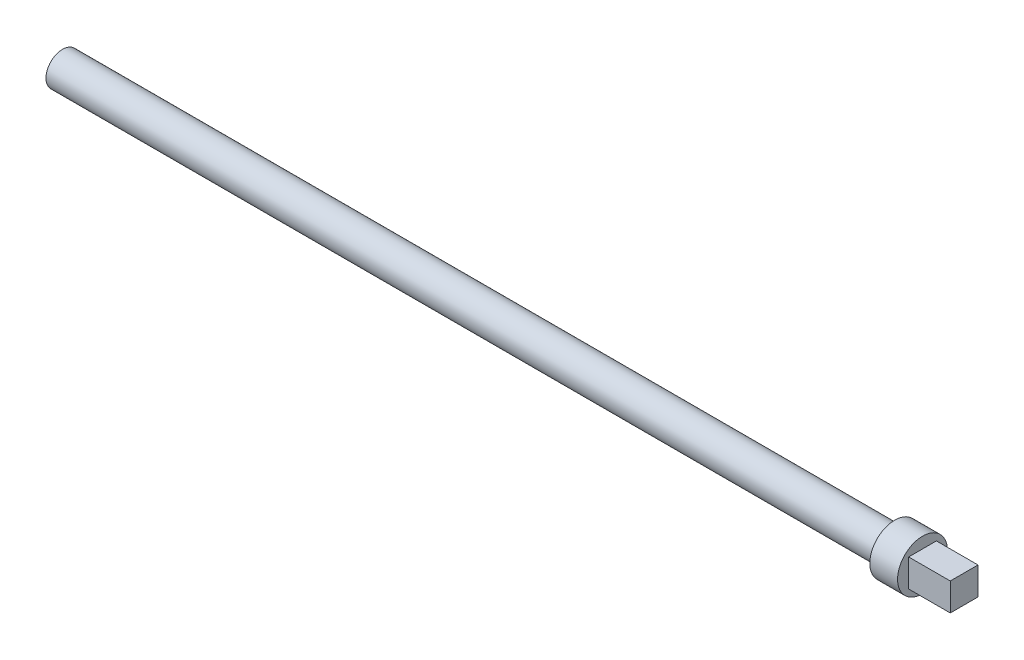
from build123d import *

# Parameters (mm, degrees)
SKETCH1_R           = 6
BOSS_EXTRUDE1_DEPTH = 150
SKETCH2_R           = 9
BOSS_EXTRUDE2_DEPTH = 10
SKETCH3_W           = 10
SKETCH3_H           = 10
BOSS_EXTRUDE3_DEPTH = 15


with BuildPart() as part:
    # Sketch1 → Boss-Extrude1 (new, symmetric)
    with BuildSketch(Plane(origin=(0, 0, 0), x_dir=(0, 0, -1), z_dir=(1, 0, 0))):
        Circle(SKETCH1_R)
    extrude(amount=BOSS_EXTRUDE1_DEPTH, both=True)

    # Sketch2 → Boss-Extrude2 (add)
    with BuildSketch(Plane(origin=(150, 0, 0), x_dir=(0, 0, -1), z_dir=(1, 0, 0))):
        Circle(SKETCH2_R)
    extrude(amount=BOSS_EXTRUDE2_DEPTH)

    # Sketch3 → Boss-Extrude3 (add)
    with BuildSketch(Plane(origin=(160, 0, 0), x_dir=(0, 0, -1), z_dir=(1, 0, 0))):
        Rectangle(SKETCH3_W, SKETCH3_H)
    extrude(amount=BOSS_EXTRUDE3_DEPTH)


solid = part.part
